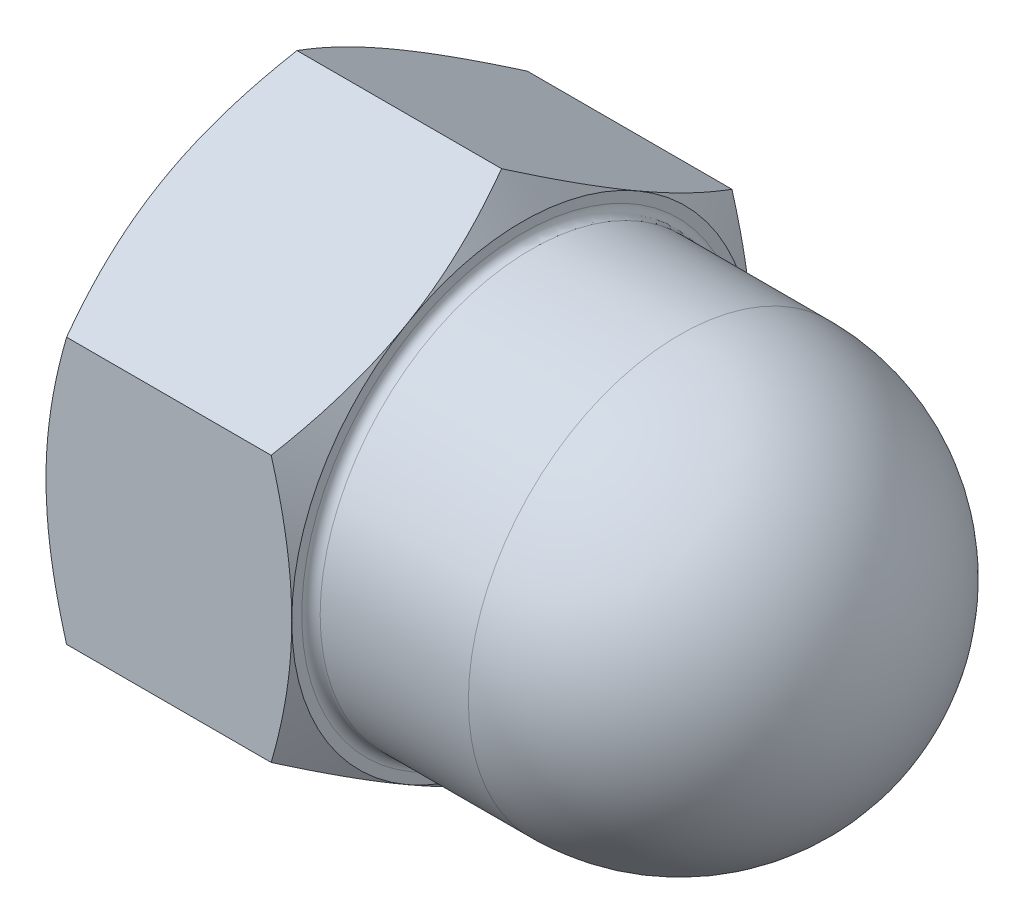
ISO-10303-21;
HEADER;
FILE_DESCRIPTION(('STEP AP214'),'2;1');
FILE_NAME('part.step','',(''),(''),'','','');
FILE_SCHEMA(('AUTOMOTIVE_DESIGN { 1 0 10303 214 1 1 1 1 }'));
ENDSEC;
DATA;
#1=APPLICATION_CONTEXT('core data for automotive mechanical design processes');
#2=APPLICATION_PROTOCOL_DEFINITION('international standard','automotive_design',2000,#1);
#3=PRODUCT_CONTEXT('',#1,'mechanical');
#4=PRODUCT('Part','Part','',(#3));
#5=PRODUCT_RELATED_PRODUCT_CATEGORY('part','',(#4));
#6=PRODUCT_DEFINITION_FORMATION('','',#4);
#7=PRODUCT_DEFINITION_CONTEXT('part definition',#1,'design');
#8=PRODUCT_DEFINITION('design','',#6,#7);
#9=PRODUCT_DEFINITION_SHAPE('','',#8);
#10=(LENGTH_UNIT() NAMED_UNIT(*) SI_UNIT(.MILLI.,.METRE.));
#11=(NAMED_UNIT(*) PLANE_ANGLE_UNIT() SI_UNIT($,.RADIAN.));
#12=(NAMED_UNIT(*) SI_UNIT($,.STERADIAN.) SOLID_ANGLE_UNIT());
#13=UNCERTAINTY_MEASURE_WITH_UNIT(LENGTH_MEASURE(1.E-05),#10,'distance_accuracy_value','');
#14=(GEOMETRIC_REPRESENTATION_CONTEXT(3) GLOBAL_UNCERTAINTY_ASSIGNED_CONTEXT((#13)) GLOBAL_UNIT_ASSIGNED_CONTEXT((#10,
#11,#12)) REPRESENTATION_CONTEXT('',''));
#15=CARTESIAN_POINT('',(0.,0.,0.));
#16=DIRECTION('',(0.,0.,1.));
#17=DIRECTION('',(1.,0.,0.));
#18=AXIS2_PLACEMENT_3D('',#15,#16,#17);
#19=CARTESIAN_POINT('',(0.,1.73205080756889,3.));
#20=DIRECTION('',(1.,0.,0.));
#21=DIRECTION('',(0.,0.,-1.));
#22=AXIS2_PLACEMENT_3D('',#19,#20,#21);
#23=PLANE('',#22);
#24=CARTESIAN_POINT('',(0.,0.,0.));
#25=DIRECTION('',(1.,0.,0.));
#26=DIRECTION('',(0.,0.,-1.));
#27=AXIS2_PLACEMENT_3D('',#24,#25,#26);
#28=CIRCLE('',#27,2.);
#29=CARTESIAN_POINT('',(0.,0.,-2.));
#30=VERTEX_POINT('',#29);
#31=EDGE_CURVE('E300',#30,#30,#28,.T.);
#32=ORIENTED_EDGE('',*,*,#31,.T.);
#33=EDGE_LOOP('',(#32));
#34=FACE_BOUND('',#33,.T.);
#35=CARTESIAN_POINT('',(0.,0.,0.));
#36=DIRECTION('',(1.,0.,0.));
#37=DIRECTION('',(0.,0.,-1.));
#38=AXIS2_PLACEMENT_3D('',#35,#36,#37);
#39=CIRCLE('',#38,3.);
#40=CARTESIAN_POINT('',(0.,0.,-3.));
#41=VERTEX_POINT('',#40);
#42=CARTESIAN_POINT('',(0.,2.59807621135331,-1.50000000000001));
#43=VERTEX_POINT('',#42);
#44=EDGE_CURVE('E181',#41,#43,#39,.T.);
#45=ORIENTED_EDGE('',*,*,#44,.F.);
#46=CARTESIAN_POINT('',(0.,-2.59807621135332,-1.49999999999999));
#47=VERTEX_POINT('',#46);
#48=EDGE_CURVE('E182',#47,#41,#39,.T.);
#49=ORIENTED_EDGE('',*,*,#48,.F.);
#50=CARTESIAN_POINT('',(0.,-2.59807621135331,1.50000000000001));
#51=VERTEX_POINT('',#50);
#52=EDGE_CURVE('E345',#51,#47,#39,.T.);
#53=ORIENTED_EDGE('',*,*,#52,.F.);
#54=CARTESIAN_POINT('',(0.,0.,3.));
#55=VERTEX_POINT('',#54);
#56=EDGE_CURVE('E350',#55,#51,#39,.T.);
#57=ORIENTED_EDGE('',*,*,#56,.F.);
#58=CARTESIAN_POINT('',(0.,0.,0.));
#59=DIRECTION('',(-1.,0.,0.));
#60=DIRECTION('',(0.,0.,1.));
#61=AXIS2_PLACEMENT_3D('',#58,#59,#60);
#62=CIRCLE('',#61,3.);
#63=CARTESIAN_POINT('',(0.,2.59807621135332,1.49999999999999));
#64=VERTEX_POINT('',#63);
#65=EDGE_CURVE('E292',#55,#64,#62,.T.);
#66=ORIENTED_EDGE('',*,*,#65,.T.);
#67=EDGE_CURVE('E352',#43,#64,#39,.T.);
#68=ORIENTED_EDGE('',*,*,#67,.F.);
#69=EDGE_LOOP('',(#45,#49,#53,#57,#66,#68));
#70=FACE_BOUND('',#69,.T.);
#71=ADVANCED_FACE('F32',(#34,#70),#23,.F.);
#72=CARTESIAN_POINT('',(3.2,1.73205080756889,3.));
#73=DIRECTION('',(1.,0.,0.));
#74=DIRECTION('',(0.,0.,-1.));
#75=AXIS2_PLACEMENT_3D('',#72,#73,#74);
#76=PLANE('',#75);
#77=CARTESIAN_POINT('',(3.2,0.,0.));
#78=DIRECTION('',(1.,0.,0.));
#79=DIRECTION('',(0.,0.,-1.));
#80=AXIS2_PLACEMENT_3D('',#77,#78,#79);
#81=CIRCLE('',#80,2.87);
#82=CARTESIAN_POINT('',(3.2,0.,-2.87));
#83=VERTEX_POINT('',#82);
#84=EDGE_CURVE('E40',#83,#83,#81,.F.);
#85=ORIENTED_EDGE('',*,*,#84,.T.);
#86=EDGE_LOOP('',(#85));
#87=FACE_BOUND('',#86,.T.);
#88=CARTESIAN_POINT('',(3.2,0.,0.));
#89=DIRECTION('',(-1.,0.,0.));
#90=DIRECTION('',(0.,0.,1.));
#91=AXIS2_PLACEMENT_3D('',#88,#89,#90);
#92=CIRCLE('',#91,3.);
#93=CARTESIAN_POINT('',(3.2,0.,-3.));
#94=VERTEX_POINT('',#93);
#95=CARTESIAN_POINT('',(3.2,-2.59807621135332,-1.5));
#96=VERTEX_POINT('',#95);
#97=EDGE_CURVE('E289',#94,#96,#92,.T.);
#98=ORIENTED_EDGE('',*,*,#97,.F.);
#99=CARTESIAN_POINT('',(3.2,2.59807621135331,-1.50000000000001));
#100=VERTEX_POINT('',#99);
#101=EDGE_CURVE('E291',#100,#94,#92,.T.);
#102=ORIENTED_EDGE('',*,*,#101,.F.);
#103=CARTESIAN_POINT('',(3.2,2.59807621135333,1.5));
#104=VERTEX_POINT('',#103);
#105=EDGE_CURVE('E295',#104,#100,#92,.T.);
#106=ORIENTED_EDGE('',*,*,#105,.F.);
#107=CARTESIAN_POINT('',(3.2,0.,3.));
#108=VERTEX_POINT('',#107);
#109=EDGE_CURVE('E293',#108,#104,#92,.T.);
#110=ORIENTED_EDGE('',*,*,#109,.F.);
#111=CARTESIAN_POINT('',(3.2,-2.59807621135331,1.50000000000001));
#112=VERTEX_POINT('',#111);
#113=EDGE_CURVE('E47',#112,#108,#92,.T.);
#114=ORIENTED_EDGE('',*,*,#113,.F.);
#115=EDGE_CURVE('E55',#96,#112,#92,.T.);
#116=ORIENTED_EDGE('',*,*,#115,.F.);
#117=EDGE_LOOP('',(#98,#102,#106,#110,#114,#116));
#118=FACE_BOUND('',#117,.T.);
#119=ADVANCED_FACE('F141',(#87,#118),#76,.T.);
#120=CARTESIAN_POINT('',(5.25,0.,0.));
#121=DIRECTION('',(-1.,0.,0.));
#122=DIRECTION('',(0.,-1.,0.));
#123=AXIS2_PLACEMENT_3D('',#120,#121,#122);
#124=SPHERICAL_SURFACE('',#123,2.75);
#125=CARTESIAN_POINT('',(5.25,0.,0.));
#126=DIRECTION('',(-1.,0.,0.));
#127=DIRECTION('',(0.,0.,1.));
#128=AXIS2_PLACEMENT_3D('',#125,#126,#127);
#129=CIRCLE('',#128,2.75);
#130=CARTESIAN_POINT('',(5.25,0.,2.75));
#131=VERTEX_POINT('',#130);
#132=EDGE_CURVE('E329',#131,#131,#129,.T.);
#133=ORIENTED_EDGE('',*,*,#132,.F.);
#134=EDGE_LOOP('',(#133));
#135=FACE_BOUND('',#134,.T.);
#136=ADVANCED_FACE('F147',(#135),#124,.T.);
#137=CARTESIAN_POINT('',(0.,0.,0.));
#138=DIRECTION('',(-1.,0.,0.));
#139=DIRECTION('',(0.,0.,1.));
#140=AXIS2_PLACEMENT_3D('',#137,#138,#139);
#141=CYLINDRICAL_SURFACE('',#140,2.75);
#142=CARTESIAN_POINT('',(3.32,0.,0.));
#143=DIRECTION('',(1.,0.,0.));
#144=DIRECTION('',(0.,0.,-1.));
#145=AXIS2_PLACEMENT_3D('',#142,#143,#144);
#146=CIRCLE('',#145,2.75);
#147=CARTESIAN_POINT('',(3.32,0.,-2.75));
#148=VERTEX_POINT('',#147);
#149=EDGE_CURVE('E11',#148,#148,#146,.T.);
#150=ORIENTED_EDGE('',*,*,#149,.T.);
#151=EDGE_LOOP('',(#150));
#152=FACE_BOUND('',#151,.T.);
#153=ORIENTED_EDGE('',*,*,#132,.T.);
#154=EDGE_LOOP('',(#153));
#155=FACE_BOUND('',#154,.T.);
#156=ADVANCED_FACE('F195',(#152,#155),#141,.T.);
#157=CARTESIAN_POINT('',(2.64337567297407,0.,0.));
#158=DIRECTION('',(-1.,0.,0.));
#159=DIRECTION('',(0.,0.,1.));
#160=AXIS2_PLACEMENT_3D('',#157,#158,#159);
#161=CONICAL_SURFACE('',#160,3.96410161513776,1.0471975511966);
#162=CARTESIAN_POINT('',(2.93198413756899,3.4642170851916,-0.000200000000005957));
#163=CARTESIAN_POINT('',(2.97594629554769,3.38810199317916,0.131635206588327));
#164=CARTESIAN_POINT('',(3.01592841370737,3.31132988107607,0.264608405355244));
#165=CARTESIAN_POINT('',(3.08571791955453,3.15645624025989,0.532857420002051));
#166=CARTESIAN_POINT('',(3.11550061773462,3.07835195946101,0.668138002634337));
#167=CARTESIAN_POINT('',(3.16186216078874,2.9231113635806,0.937022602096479));
#168=CARTESIAN_POINT('',(3.17874955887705,2.84599893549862,1.07058524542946));
#169=CARTESIAN_POINT('',(3.19891035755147,2.69141120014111,1.33833905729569));
#170=CARTESIAN_POINT('',(3.20220045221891,2.61393645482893,1.47252925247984));
#171=CARTESIAN_POINT('',(3.1953594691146,2.46916798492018,1.7232755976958));
#172=CARTESIAN_POINT('',(3.18690808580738,2.40185259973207,1.83986926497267));
#173=CARTESIAN_POINT('',(3.16012105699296,2.26766039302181,2.07229698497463));
#174=CARTESIAN_POINT('',(3.14177625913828,2.20078403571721,2.18813023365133));
#175=CARTESIAN_POINT('',(3.09591524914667,2.06631510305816,2.42103725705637));
#176=CARTESIAN_POINT('',(3.06820461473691,1.99873954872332,2.53808155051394));
#177=CARTESIAN_POINT('',(3.0053122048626,1.8645963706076,2.77042435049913));
#178=CARTESIAN_POINT('',(2.97014520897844,1.79802702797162,2.88572583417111));
#179=CARTESIAN_POINT('',(2.93198413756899,1.73193533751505,3.0002));
#180=B_SPLINE_CURVE_WITH_KNOTS('',3,(#162,#163,#164,#165,#166,#167,#168,#169,#170,#171,#172,
#173,#174,#175,#176,#177,#178,#179),.UNSPECIFIED.,.F.,.F.,(4,2,2,2,2,2,2,2,4),(0.,
0.475539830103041,0.952222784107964,1.41710776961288,1.88142182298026,2.28572436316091,
2.69040156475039,3.10405572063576,3.51689749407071),.UNSPECIFIED.);
#181=CARTESIAN_POINT('',(2.93205080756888,3.46410161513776,0.));
#182=VERTEX_POINT('',#181);
#183=EDGE_CURVE('E209',#182,#104,#180,.T.);
#184=ORIENTED_EDGE('',*,*,#183,.T.);
#185=ORIENTED_EDGE('',*,*,#105,.T.);
#186=CARTESIAN_POINT('',(2.93198413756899,1.73193533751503,-3.0002));
#187=CARTESIAN_POINT('',(2.9759462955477,1.80805042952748,-2.86836479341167));
#188=CARTESIAN_POINT('',(3.01592841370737,1.88482254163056,-2.73539159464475));
#189=CARTESIAN_POINT('',(3.08571791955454,2.03969618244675,-2.46714257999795));
#190=CARTESIAN_POINT('',(3.11550061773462,2.11780046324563,-2.33186199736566));
#191=CARTESIAN_POINT('',(3.16186216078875,2.27304105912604,-2.06297739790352));
#192=CARTESIAN_POINT('',(3.17874955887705,2.35015348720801,-1.92941475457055));
#193=CARTESIAN_POINT('',(3.19891035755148,2.50474122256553,-1.66166094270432));
#194=CARTESIAN_POINT('',(3.20220045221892,2.58221596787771,-1.52747074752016));
#195=CARTESIAN_POINT('',(3.19535946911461,2.72698443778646,-1.2767244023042));
#196=CARTESIAN_POINT('',(3.18690808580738,2.79429982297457,-1.16013073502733));
#197=CARTESIAN_POINT('',(3.16012105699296,2.92849202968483,-0.927703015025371));
#198=CARTESIAN_POINT('',(3.14177625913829,2.99536838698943,-0.811869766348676));
#199=CARTESIAN_POINT('',(3.09591524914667,3.12983731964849,-0.578962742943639));
#200=CARTESIAN_POINT('',(3.06820461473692,3.19741287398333,-0.461918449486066));
#201=CARTESIAN_POINT('',(3.0053122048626,3.33155605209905,-0.229575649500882));
#202=CARTESIAN_POINT('',(2.97014520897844,3.39812539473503,-0.1142741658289));
#203=CARTESIAN_POINT('',(2.93198413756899,3.4642170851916,0.000199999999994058));
#204=B_SPLINE_CURVE_WITH_KNOTS('',3,(#186,#187,#188,#189,#190,#191,#192,#193,#194,#195,#196,
#197,#198,#199,#200,#201,#202,#203),.UNSPECIFIED.,.F.,.F.,(4,2,2,2,2,2,2,2,4),(0.,
0.475539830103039,0.952222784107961,1.41710776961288,1.88142182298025,2.28572436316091,
2.69040156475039,3.10405572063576,3.5168974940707),.UNSPECIFIED.);
#205=EDGE_CURVE('E173',#100,#182,#204,.T.);
#206=ORIENTED_EDGE('',*,*,#205,.T.);
#207=EDGE_LOOP('',(#184,#185,#206));
#208=FACE_BOUND('',#207,.T.);
#209=ADVANCED_FACE('F191',(#208),#161,.T.);
#210=CARTESIAN_POINT('',(2.93205080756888,1.73205080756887,-3.));
#211=VERTEX_POINT('',#210);
#212=EDGE_CURVE('E180',#211,#100,#204,.T.);
#213=ORIENTED_EDGE('',*,*,#212,.T.);
#214=ORIENTED_EDGE('',*,*,#101,.T.);
#215=CARTESIAN_POINT('',(1.74498110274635,-4.63381483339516,-3.));
#216=CARTESIAN_POINT('',(1.80839045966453,-4.50294269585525,-3.));
#217=CARTESIAN_POINT('',(1.87118639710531,-4.37176811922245,-3.));
#218=CARTESIAN_POINT('',(1.99520605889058,-4.10865318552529,-3.));
#219=CARTESIAN_POINT('',(2.05642953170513,-3.97671271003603,-3.));
#220=CARTESIAN_POINT('',(2.17727092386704,-3.71121624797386,-3.));
#221=CARTESIAN_POINT('',(2.23687812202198,-3.57765536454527,-3.));
#222=CARTESIAN_POINT('',(2.35362814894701,-3.30946475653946,-3.));
#223=CARTESIAN_POINT('',(2.41077109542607,-3.17483508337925,-3.));
#224=CARTESIAN_POINT('',(2.5236989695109,-2.90001561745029,-3.));
#225=CARTESIAN_POINT('',(2.57938396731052,-2.75978453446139,-3.));
#226=CARTESIAN_POINT('',(2.68649405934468,-2.47767482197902,-3.));
#227=CARTESIAN_POINT('',(2.73791867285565,-2.33579600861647,-3.));
#228=CARTESIAN_POINT('',(2.83514427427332,-2.05043684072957,-3.));
#229=CARTESIAN_POINT('',(2.88095681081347,-1.90696046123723,-3.));
#230=CARTESIAN_POINT('',(2.96547582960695,-1.61794974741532,-3.));
#231=CARTESIAN_POINT('',(3.00418457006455,-1.47241608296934,-3.));
#232=CARTESIAN_POINT('',(3.07242055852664,-1.18001482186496,-3.));
#233=CARTESIAN_POINT('',(3.10199702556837,-1.0331589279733,-3.));
#234=CARTESIAN_POINT('',(3.15028461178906,-0.73764051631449,-3.));
#235=CARTESIAN_POINT('',(3.16899672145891,-0.58897816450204,-3.));
#236=CARTESIAN_POINT('',(3.19381749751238,-0.292523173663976,-3.));
#237=CARTESIAN_POINT('',(3.2000866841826,-0.144744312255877,-3.));
#238=CARTESIAN_POINT('',(3.19991154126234,0.150817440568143,-3.));
#239=CARTESIAN_POINT('',(3.19346693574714,0.298600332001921,-3.));
#240=CARTESIAN_POINT('',(3.17213777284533,0.55005252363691,-3.));
#241=CARTESIAN_POINT('',(3.16026989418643,0.653993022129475,-3.));
#242=CARTESIAN_POINT('',(3.13099429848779,0.861098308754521,-3.));
#243=CARTESIAN_POINT('',(3.11358581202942,0.964262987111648,-3.));
#244=CARTESIAN_POINT('',(3.05396332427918,1.27245094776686,-3.));
#245=CARTESIAN_POINT('',(3.0043637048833,1.47604918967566,-3.));
#246=CARTESIAN_POINT('',(2.88958639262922,1.88346424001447,-3.));
#247=CARTESIAN_POINT('',(2.8240911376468,2.08718806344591,-3.));
#248=CARTESIAN_POINT('',(2.7180431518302,2.38995030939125,-3.));
#249=CARTESIAN_POINT('',(2.68139740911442,2.49038964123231,-3.));
#250=CARTESIAN_POINT('',(2.60591450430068,2.69044155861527,-3.));
#251=CARTESIAN_POINT('',(2.56707736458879,2.79005415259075,-3.));
#252=CARTESIAN_POINT('',(2.47504550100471,3.01984681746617,-3.));
#253=CARTESIAN_POINT('',(2.4211855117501,3.14975962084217,-3.));
#254=CARTESIAN_POINT('',(2.31095678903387,3.40851905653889,-3.));
#255=CARTESIAN_POINT('',(2.25458792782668,3.53736563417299,-3.));
#256=CARTESIAN_POINT('',(2.08247392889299,3.92261344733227,-3.));
#257=CARTESIAN_POINT('',(1.96373985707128,4.17767769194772,-3.));
#258=CARTESIAN_POINT('',(1.72092663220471,4.68551897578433,-3.));
#259=CARTESIAN_POINT('',(1.59684252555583,4.93829362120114,-3.));
#260=CARTESIAN_POINT('',(1.34504342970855,5.44203435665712,-3.));
#261=CARTESIAN_POINT('',(1.2173283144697,5.69300038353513,-3.));
#262=CARTESIAN_POINT('',(0.969697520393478,6.17344673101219,-3.));
#263=CARTESIAN_POINT('',(0.849981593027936,6.40303035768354,-3.));
#264=CARTESIAN_POINT('',(0.60889531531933,6.86133570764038,-3.));
#265=CARTESIAN_POINT('',(0.487524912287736,7.09005740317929,-3.));
#266=CARTESIAN_POINT('',(0.243802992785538,7.54629005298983,-3.));
#267=CARTESIAN_POINT('',(0.121454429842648,7.77380258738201,-3.));
#268=CARTESIAN_POINT('',(-0.124240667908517,8.22827314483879,-3.));
#269=CARTESIAN_POINT('',(-0.247587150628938,8.45523119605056,-3.));
#270=CARTESIAN_POINT('',(-0.371307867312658,8.68198362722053,-3.));
#271=B_SPLINE_CURVE_WITH_KNOTS('',3,(#215,#216,#217,#218,#219,#220,#221,#222,#223,#224,#225,
#226,#227,#228,#229,#230,#231,#232,#233,#234,#235,#236,#237,#238,#239,#240,#241,#242,#243,#244,
#245,#246,#247,#248,#249,#250,#251,#252,#253,#254,#255,#256,#257,#258,#259,#260,#261,#262,#263,
#264,#265,#266,#267,#268,#269,#270),.UNSPECIFIED.,.F.,.F.,(4,2,2,2,2,2,2,2,2,2,2,2,2,2,2,2,2,2,
2,2,2,2,2,2,2,2,2,4),(0.,0.43627869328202,0.872626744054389,1.31138210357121,1.7501164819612,
2.2027109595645,2.65535643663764,3.10705422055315,3.55860816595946,4.00768414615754,
4.45671917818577,4.89992276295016,5.34313596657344,5.65683214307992,5.97057190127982,
6.59840828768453,7.24000322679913,7.56073051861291,7.88145453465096,8.30332567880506,
8.72521832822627,9.56914969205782,10.4138799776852,11.2586396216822,12.0353974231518,
12.8121800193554,13.5871483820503,14.3620765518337),.UNSPECIFIED.);
#272=EDGE_CURVE('E202',#211,#94,#271,.F.);
#273=ORIENTED_EDGE('',*,*,#272,.F.);
#274=EDGE_LOOP('',(#213,#214,#273));
#275=FACE_BOUND('',#274,.T.);
#276=ADVANCED_FACE('F186',(#275),#161,.T.);
#277=CARTESIAN_POINT('',(2.93198413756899,-3.4642170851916,0.000200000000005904));
#278=CARTESIAN_POINT('',(2.97594629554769,-3.38810199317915,-0.131635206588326));
#279=CARTESIAN_POINT('',(3.01592841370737,-3.31132988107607,-0.264608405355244));
#280=CARTESIAN_POINT('',(3.08571791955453,-3.15645624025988,-0.532857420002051));
#281=CARTESIAN_POINT('',(3.11550061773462,-3.078351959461,-0.668138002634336));
#282=CARTESIAN_POINT('',(3.16186216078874,-2.92311136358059,-0.937022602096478));
#283=CARTESIAN_POINT('',(3.17874955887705,-2.84599893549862,-1.07058524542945));
#284=CARTESIAN_POINT('',(3.19891035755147,-2.6914112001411,-1.33833905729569));
#285=CARTESIAN_POINT('',(3.20220045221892,-2.61393645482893,-1.47252925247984));
#286=CARTESIAN_POINT('',(3.19535946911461,-2.46916798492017,-1.7232755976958));
#287=CARTESIAN_POINT('',(3.18690808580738,-2.40185259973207,-1.83986926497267));
#288=CARTESIAN_POINT('',(3.16012105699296,-2.26766039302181,-2.07229698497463));
#289=CARTESIAN_POINT('',(3.14177625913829,-2.20078403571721,-2.18813023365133));
#290=CARTESIAN_POINT('',(3.09591524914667,-2.06631510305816,-2.42103725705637));
#291=CARTESIAN_POINT('',(3.06820461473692,-1.99873954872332,-2.53808155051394));
#292=CARTESIAN_POINT('',(3.0053122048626,-1.8645963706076,-2.77042435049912));
#293=CARTESIAN_POINT('',(2.97014520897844,-1.79802702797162,-2.88572583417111));
#294=CARTESIAN_POINT('',(2.93198413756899,-1.73193533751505,-3.0002));
#295=B_SPLINE_CURVE_WITH_KNOTS('',3,(#277,#278,#279,#280,#281,#282,#283,#284,#285,#286,#287,
#288,#289,#290,#291,#292,#293,#294),.UNSPECIFIED.,.F.,.F.,(4,2,2,2,2,2,2,2,4),(0.,
0.475539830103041,0.952222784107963,1.41710776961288,1.88142182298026,2.28572436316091,
2.69040156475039,3.10405572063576,3.5168974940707),.UNSPECIFIED.);
#296=CARTESIAN_POINT('',(2.9320508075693,-1.73205080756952,-3.));
#297=VERTEX_POINT('',#296);
#298=EDGE_CURVE('E214',#96,#297,#295,.T.);
#299=ORIENTED_EDGE('',*,*,#298,.T.);
#300=EDGE_CURVE('E267',#94,#297,#271,.F.);
#301=ORIENTED_EDGE('',*,*,#300,.F.);
#302=ORIENTED_EDGE('',*,*,#97,.T.);
#303=EDGE_LOOP('',(#299,#301,#302));
#304=FACE_BOUND('',#303,.T.);
#305=ADVANCED_FACE('F190',(#304),#161,.T.);
#306=CARTESIAN_POINT('',(2.931984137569,-1.73193533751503,3.0002));
#307=CARTESIAN_POINT('',(2.9759462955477,-1.80805042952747,2.86836479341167));
#308=CARTESIAN_POINT('',(3.01592841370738,-1.88482254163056,2.73539159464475));
#309=CARTESIAN_POINT('',(3.08571791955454,-2.03969618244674,2.46714257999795));
#310=CARTESIAN_POINT('',(3.11550061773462,-2.11780046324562,2.33186199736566));
#311=CARTESIAN_POINT('',(3.16186216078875,-2.27304105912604,2.06297739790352));
#312=CARTESIAN_POINT('',(3.17874955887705,-2.35015348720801,1.92941475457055));
#313=CARTESIAN_POINT('',(3.19891035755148,-2.50474122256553,1.66166094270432));
#314=CARTESIAN_POINT('',(3.20220045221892,-2.58221596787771,1.52747074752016));
#315=CARTESIAN_POINT('',(3.19535946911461,-2.72698443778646,1.2767244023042));
#316=CARTESIAN_POINT('',(3.18690808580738,-2.79429982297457,1.16013073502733));
#317=CARTESIAN_POINT('',(3.16012105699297,-2.92849202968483,0.927703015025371));
#318=CARTESIAN_POINT('',(3.14177625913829,-2.99536838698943,0.811869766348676));
#319=CARTESIAN_POINT('',(3.09591524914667,-3.12983731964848,0.57896274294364));
#320=CARTESIAN_POINT('',(3.06820461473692,-3.19741287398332,0.461918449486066));
#321=CARTESIAN_POINT('',(3.0053122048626,-3.33155605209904,0.229575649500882));
#322=CARTESIAN_POINT('',(2.97014520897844,-3.39812539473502,0.1142741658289));
#323=CARTESIAN_POINT('',(2.93198413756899,-3.4642170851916,-0.000199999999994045));
#324=B_SPLINE_CURVE_WITH_KNOTS('',3,(#306,#307,#308,#309,#310,#311,#312,#313,#314,#315,#316,
#317,#318,#319,#320,#321,#322,#323),.UNSPECIFIED.,.F.,.F.,(4,2,2,2,2,2,2,2,4),(0.,
0.475539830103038,0.95222278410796,1.41710776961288,1.88142182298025,2.28572436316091,
2.69040156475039,3.10405572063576,3.5168974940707),.UNSPECIFIED.);
#325=CARTESIAN_POINT('',(2.93205080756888,-3.46410161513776,0.));
#326=VERTEX_POINT('',#325);
#327=EDGE_CURVE('E219',#112,#326,#324,.T.);
#328=ORIENTED_EDGE('',*,*,#327,.T.);
#329=EDGE_CURVE('E225',#326,#96,#295,.T.);
#330=ORIENTED_EDGE('',*,*,#329,.T.);
#331=ORIENTED_EDGE('',*,*,#115,.T.);
#332=EDGE_LOOP('',(#328,#330,#331));
#333=FACE_BOUND('',#332,.T.);
#334=ADVANCED_FACE('F279',(#333),#161,.T.);
#335=CARTESIAN_POINT('',(1.74498110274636,-4.63381483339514,3.));
#336=CARTESIAN_POINT('',(1.80839045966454,-4.50294269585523,3.));
#337=CARTESIAN_POINT('',(1.87118639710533,-4.37176811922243,3.));
#338=CARTESIAN_POINT('',(1.99520605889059,-4.10865318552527,3.));
#339=CARTESIAN_POINT('',(2.05642953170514,-3.976712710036,3.));
#340=CARTESIAN_POINT('',(2.17727092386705,-3.71121624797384,3.));
#341=CARTESIAN_POINT('',(2.23687812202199,-3.57765536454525,3.));
#342=CARTESIAN_POINT('',(2.35362814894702,-3.30946475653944,3.));
#343=CARTESIAN_POINT('',(2.41077109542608,-3.17483508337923,3.));
#344=CARTESIAN_POINT('',(2.52369896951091,-2.90001561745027,3.));
#345=CARTESIAN_POINT('',(2.57938396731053,-2.75978453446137,3.));
#346=CARTESIAN_POINT('',(2.68649405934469,-2.477674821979,3.));
#347=CARTESIAN_POINT('',(2.73791867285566,-2.33579600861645,3.));
#348=CARTESIAN_POINT('',(2.83514427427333,-2.05043684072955,3.));
#349=CARTESIAN_POINT('',(2.88095681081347,-1.90696046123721,3.));
#350=CARTESIAN_POINT('',(2.96547582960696,-1.6179497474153,3.));
#351=CARTESIAN_POINT('',(3.00418457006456,-1.47241608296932,3.));
#352=CARTESIAN_POINT('',(3.07242055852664,-1.18001482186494,3.));
#353=CARTESIAN_POINT('',(3.10199702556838,-1.03315892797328,3.));
#354=CARTESIAN_POINT('',(3.15028461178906,-0.737640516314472,3.));
#355=CARTESIAN_POINT('',(3.16899672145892,-0.588978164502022,3.));
#356=CARTESIAN_POINT('',(3.19381749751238,-0.292523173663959,3.));
#357=CARTESIAN_POINT('',(3.2000866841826,-0.14474431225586,3.));
#358=CARTESIAN_POINT('',(3.19991154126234,0.15081744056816,3.));
#359=CARTESIAN_POINT('',(3.19346693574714,0.298600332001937,3.));
#360=CARTESIAN_POINT('',(3.17213777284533,0.550052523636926,3.));
#361=CARTESIAN_POINT('',(3.16026989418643,0.653993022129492,3.));
#362=CARTESIAN_POINT('',(3.13099429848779,0.861098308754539,3.));
#363=CARTESIAN_POINT('',(3.11358581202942,0.964262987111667,3.));
#364=CARTESIAN_POINT('',(3.05396332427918,1.27245094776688,3.));
#365=CARTESIAN_POINT('',(3.0043637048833,1.47604918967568,3.));
#366=CARTESIAN_POINT('',(2.88958639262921,1.88346424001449,3.));
#367=CARTESIAN_POINT('',(2.82409113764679,2.08718806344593,3.));
#368=CARTESIAN_POINT('',(2.71804315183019,2.38995030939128,3.));
#369=CARTESIAN_POINT('',(2.68139740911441,2.49038964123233,3.));
#370=CARTESIAN_POINT('',(2.60591450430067,2.6904415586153,3.));
#371=CARTESIAN_POINT('',(2.56707736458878,2.79005415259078,3.));
#372=CARTESIAN_POINT('',(2.4750455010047,3.0198468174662,3.));
#373=CARTESIAN_POINT('',(2.42118551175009,3.14975962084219,3.));
#374=CARTESIAN_POINT('',(2.31095678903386,3.40851905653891,3.));
#375=CARTESIAN_POINT('',(2.25458792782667,3.53736563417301,3.));
#376=CARTESIAN_POINT('',(2.08247392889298,3.9226134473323,3.));
#377=CARTESIAN_POINT('',(1.96373985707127,4.17767769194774,3.));
#378=CARTESIAN_POINT('',(1.7209266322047,4.68551897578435,3.));
#379=CARTESIAN_POINT('',(1.59684252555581,4.93829362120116,3.));
#380=CARTESIAN_POINT('',(1.34504342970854,5.44203435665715,3.));
#381=CARTESIAN_POINT('',(1.21732831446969,5.69300038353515,3.));
#382=CARTESIAN_POINT('',(0.969697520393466,6.17344673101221,3.));
#383=CARTESIAN_POINT('',(0.849981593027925,6.40303035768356,3.));
#384=CARTESIAN_POINT('',(0.608895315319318,6.8613357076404,3.));
#385=CARTESIAN_POINT('',(0.487524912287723,7.09005740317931,3.));
#386=CARTESIAN_POINT('',(0.243802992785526,7.54629005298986,3.));
#387=CARTESIAN_POINT('',(0.121454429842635,7.77380258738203,3.));
#388=CARTESIAN_POINT('',(-0.124240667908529,8.22827314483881,3.));
#389=CARTESIAN_POINT('',(-0.24758715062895,8.45523119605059,3.));
#390=CARTESIAN_POINT('',(-0.37130786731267,8.68198362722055,3.));
#391=B_SPLINE_CURVE_WITH_KNOTS('',3,(#335,#336,#337,#338,#339,#340,#341,#342,#343,#344,#345,
#346,#347,#348,#349,#350,#351,#352,#353,#354,#355,#356,#357,#358,#359,#360,#361,#362,#363,#364,
#365,#366,#367,#368,#369,#370,#371,#372,#373,#374,#375,#376,#377,#378,#379,#380,#381,#382,#383,
#384,#385,#386,#387,#388,#389,#390),.UNSPECIFIED.,.F.,.F.,(4,2,2,2,2,2,2,2,2,2,2,2,2,2,2,2,2,2,
2,2,2,2,2,2,2,2,2,4),(0.,0.436278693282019,0.872626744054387,1.3113821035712,1.7501164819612,
2.2027109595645,2.65535643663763,3.10705422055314,3.55860816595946,4.00768414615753,
4.45671917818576,4.89992276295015,5.34313596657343,5.65683214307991,5.97057190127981,
6.59840828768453,7.24000322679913,7.56073051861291,7.88145453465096,8.30332567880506,
8.72521832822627,9.56914969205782,10.4138799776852,11.2586396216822,12.0353974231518,
12.8121800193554,13.5871483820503,14.3620765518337),.UNSPECIFIED.);
#392=CARTESIAN_POINT('',(2.93205080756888,-1.73205080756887,3.));
#393=VERTEX_POINT('',#392);
#394=EDGE_CURVE('E226',#108,#393,#391,.F.);
#395=ORIENTED_EDGE('',*,*,#394,.T.);
#396=EDGE_CURVE('E224',#393,#112,#324,.T.);
#397=ORIENTED_EDGE('',*,*,#396,.T.);
#398=ORIENTED_EDGE('',*,*,#113,.T.);
#399=EDGE_LOOP('',(#395,#397,#398));
#400=FACE_BOUND('',#399,.T.);
#401=ADVANCED_FACE('F517',(#400),#161,.T.);
#402=CARTESIAN_POINT('',(2.93205080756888,1.73205080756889,3.));
#403=VERTEX_POINT('',#402);
#404=EDGE_CURVE('E273',#104,#403,#180,.T.);
#405=ORIENTED_EDGE('',*,*,#404,.T.);
#406=EDGE_CURVE('E365',#403,#108,#391,.F.);
#407=ORIENTED_EDGE('',*,*,#406,.T.);
#408=ORIENTED_EDGE('',*,*,#109,.T.);
#409=EDGE_LOOP('',(#405,#407,#408));
#410=FACE_BOUND('',#409,.T.);
#411=ADVANCED_FACE('F159',(#410),#161,.T.);
#412=CARTESIAN_POINT('',(3.2,1.73205080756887,-3.));
#413=DIRECTION('',(0.,-0.866025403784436,0.500000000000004));
#414=DIRECTION('',(0.,-0.500000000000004,-0.866025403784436));
#415=AXIS2_PLACEMENT_3D('',#412,#413,#414);
#416=PLANE('',#415);
#417=ORIENTED_EDGE('',*,*,#212,.F.);
#418=DIRECTION('',(-1.,0.,0.));
#419=VECTOR('',#418,1.);
#420=CARTESIAN_POINT('',(3.2,1.73205080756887,-3.));
#421=LINE('',#420,#419);
#422=CARTESIAN_POINT('',(0.267949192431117,1.73205080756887,-3.));
#423=VERTEX_POINT('',#422);
#424=EDGE_CURVE('E328',#211,#423,#421,.T.);
#425=ORIENTED_EDGE('',*,*,#424,.T.);
#426=CARTESIAN_POINT('',(0.268015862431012,3.4642170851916,0.000199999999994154));
#427=CARTESIAN_POINT('',(0.224053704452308,3.38810199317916,-0.131635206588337));
#428=CARTESIAN_POINT('',(0.18407158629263,3.31132988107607,-0.264608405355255));
#429=CARTESIAN_POINT('',(0.114282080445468,3.15645624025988,-0.53285742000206));
#430=CARTESIAN_POINT('',(0.0844993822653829,3.078351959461,-0.668138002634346));
#431=CARTESIAN_POINT('',(0.0381378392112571,2.92311136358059,-0.937022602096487));
#432=CARTESIAN_POINT('',(0.0212504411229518,2.84599893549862,-1.07058524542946));
#433=CARTESIAN_POINT('',(0.0010896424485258,2.6914112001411,-1.33833905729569));
#434=CARTESIAN_POINT('',(-0.00220045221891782,2.61393645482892,-1.47252925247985));
#435=CARTESIAN_POINT('',(0.0046405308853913,2.46916798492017,-1.72327559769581));
#436=CARTESIAN_POINT('',(0.0130919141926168,2.40185259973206,-1.83986926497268));
#437=CARTESIAN_POINT('',(0.0398789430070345,2.2676603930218,-2.07229698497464));
#438=CARTESIAN_POINT('',(0.0582237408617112,2.2007840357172,-2.18813023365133));
#439=CARTESIAN_POINT('',(0.104084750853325,2.06631510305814,-2.42103725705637));
#440=CARTESIAN_POINT('',(0.13179538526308,1.9987395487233,-2.53808155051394));
#441=CARTESIAN_POINT('',(0.194687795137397,1.86459637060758,-2.77042435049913));
#442=CARTESIAN_POINT('',(0.229854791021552,1.7980270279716,-2.88572583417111));
#443=CARTESIAN_POINT('',(0.268015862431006,1.73193533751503,-3.0002));
#444=B_SPLINE_CURVE_WITH_KNOTS('',3,(#426,#427,#428,#429,#430,#431,#432,#433,#434,#435,#436,
#437,#438,#439,#440,#441,#442,#443),.UNSPECIFIED.,.F.,.F.,(4,2,2,2,2,2,2,2,4),(0.,
0.47553983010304,0.952222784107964,1.41710776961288,1.88142182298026,2.28572436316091,
2.69040156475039,3.10405572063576,3.5168974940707),.UNSPECIFIED.);
#445=EDGE_CURVE('E165',#43,#423,#444,.T.);
#446=ORIENTED_EDGE('',*,*,#445,.F.);
#447=CARTESIAN_POINT('',(0.267949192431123,3.46410161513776,0.));
#448=VERTEX_POINT('',#447);
#449=EDGE_CURVE('E325',#448,#43,#444,.T.);
#450=ORIENTED_EDGE('',*,*,#449,.F.);
#451=DIRECTION('',(-1.,0.,0.));
#452=VECTOR('',#451,1.);
#453=CARTESIAN_POINT('',(3.2,3.46410161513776,0.));
#454=LINE('',#453,#452);
#455=EDGE_CURVE('E322',#182,#448,#454,.T.);
#456=ORIENTED_EDGE('',*,*,#455,.F.);
#457=ORIENTED_EDGE('',*,*,#205,.F.);
#458=EDGE_LOOP('',(#417,#425,#446,#450,#456,#457));
#459=FACE_BOUND('',#458,.T.);
#460=ADVANCED_FACE('F154',(#459),#416,.F.);
#461=CARTESIAN_POINT('',(3.2,1.73205080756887,-3.));
#462=DIRECTION('',(0.,0.,-1.));
#463=DIRECTION('',(0.,1.,0.));
#464=AXIS2_PLACEMENT_3D('',#461,#462,#463);
#465=PLANE('',#464);
#466=ORIENTED_EDGE('',*,*,#424,.F.);
#467=ORIENTED_EDGE('',*,*,#272,.T.);
#468=ORIENTED_EDGE('',*,*,#300,.T.);
#469=DIRECTION('',(-1.,0.,0.));
#470=VECTOR('',#469,1.);
#471=CARTESIAN_POINT('',(3.2,-1.73205080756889,-3.));
#472=LINE('',#471,#470);
#473=CARTESIAN_POINT('',(0.267949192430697,-1.73205080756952,-3.));
#474=VERTEX_POINT('',#473);
#475=EDGE_CURVE('E285',#297,#474,#472,.T.);
#476=ORIENTED_EDGE('',*,*,#475,.T.);
#477=CARTESIAN_POINT('',(1.45501889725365,-4.63381483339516,-3.));
#478=CARTESIAN_POINT('',(1.39160954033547,-4.50294269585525,-3.));
#479=CARTESIAN_POINT('',(1.32881360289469,-4.37176811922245,-3.));
#480=CARTESIAN_POINT('',(1.20479394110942,-4.10865318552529,-3.));
#481=CARTESIAN_POINT('',(1.14357046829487,-3.97671271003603,-3.));
#482=CARTESIAN_POINT('',(1.02272907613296,-3.71121624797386,-3.));
#483=CARTESIAN_POINT('',(0.963121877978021,-3.57765536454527,-3.));
#484=CARTESIAN_POINT('',(0.846371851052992,-3.30946475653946,-3.));
#485=CARTESIAN_POINT('',(0.789228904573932,-3.17483508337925,-3.));
#486=CARTESIAN_POINT('',(0.676301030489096,-2.90001561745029,-3.));
#487=CARTESIAN_POINT('',(0.620616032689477,-2.7597845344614,-3.));
#488=CARTESIAN_POINT('',(0.51350594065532,-2.47767482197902,-3.));
#489=CARTESIAN_POINT('',(0.462081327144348,-2.33579600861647,-3.));
#490=CARTESIAN_POINT('',(0.364855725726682,-2.05043684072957,-3.));
#491=CARTESIAN_POINT('',(0.319043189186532,-1.90696046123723,-3.));
#492=CARTESIAN_POINT('',(0.234524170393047,-1.61794974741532,-3.));
#493=CARTESIAN_POINT('',(0.195815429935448,-1.47241608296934,-3.));
#494=CARTESIAN_POINT('',(0.127579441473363,-1.18001482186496,-3.));
#495=CARTESIAN_POINT('',(0.0980029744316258,-1.0331589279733,-3.));
#496=CARTESIAN_POINT('',(0.0497153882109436,-0.737640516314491,-3.));
#497=CARTESIAN_POINT('',(0.0310032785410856,-0.588978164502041,-3.));
#498=CARTESIAN_POINT('',(0.00618250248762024,-0.292523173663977,-3.));
#499=CARTESIAN_POINT('',(-8.6684182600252E-05,-0.144744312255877,-3.));
#500=CARTESIAN_POINT('',(8.84587376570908E-05,0.150817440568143,-3.));
#501=CARTESIAN_POINT('',(0.00653306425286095,0.298600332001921,-3.));
#502=CARTESIAN_POINT('',(0.027862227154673,0.55005252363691,-3.));
#503=CARTESIAN_POINT('',(0.0397301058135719,0.653993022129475,-3.));
#504=CARTESIAN_POINT('',(0.0690057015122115,0.861098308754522,-3.));
#505=CARTESIAN_POINT('',(0.086414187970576,0.964262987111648,-3.));
#506=CARTESIAN_POINT('',(0.14603667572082,1.27245094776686,-3.));
#507=CARTESIAN_POINT('',(0.195636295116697,1.47604918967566,-3.));
#508=CARTESIAN_POINT('',(0.310413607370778,1.88346424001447,-3.));
#509=CARTESIAN_POINT('',(0.375908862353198,2.08718806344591,-3.));
#510=CARTESIAN_POINT('',(0.481956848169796,2.38995030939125,-3.));
#511=CARTESIAN_POINT('',(0.518602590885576,2.49038964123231,-3.));
#512=CARTESIAN_POINT('',(0.59408549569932,2.69044155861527,-3.));
#513=CARTESIAN_POINT('',(0.632922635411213,2.79005415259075,-3.));
#514=CARTESIAN_POINT('',(0.724954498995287,3.01984681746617,-3.));
#515=CARTESIAN_POINT('',(0.778814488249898,3.14975962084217,-3.));
#516=CARTESIAN_POINT('',(0.889043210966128,3.40851905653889,-3.));
#517=CARTESIAN_POINT('',(0.945412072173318,3.53736563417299,-3.));
#518=CARTESIAN_POINT('',(1.11752607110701,3.92261344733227,-3.));
#519=CARTESIAN_POINT('',(1.23626014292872,4.17767769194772,-3.));
#520=CARTESIAN_POINT('',(1.47907336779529,4.68551897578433,-3.));
#521=CARTESIAN_POINT('',(1.60315747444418,4.93829362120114,-3.));
#522=CARTESIAN_POINT('',(1.85495657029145,5.44203435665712,-3.));
#523=CARTESIAN_POINT('',(1.9826716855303,5.69300038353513,-3.));
#524=CARTESIAN_POINT('',(2.23030247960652,6.17344673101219,-3.));
#525=CARTESIAN_POINT('',(2.35001840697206,6.40303035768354,-3.));
#526=CARTESIAN_POINT('',(2.59110468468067,6.86133570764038,-3.));
#527=CARTESIAN_POINT('',(2.71247508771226,7.09005740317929,-3.));
#528=CARTESIAN_POINT('',(2.95619700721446,7.54629005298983,-3.));
#529=CARTESIAN_POINT('',(3.07854557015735,7.77380258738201,-3.));
#530=CARTESIAN_POINT('',(3.32424066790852,8.22827314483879,-3.));
#531=CARTESIAN_POINT('',(3.44758715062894,8.45523119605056,-3.));
#532=CARTESIAN_POINT('',(3.57130786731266,8.68198362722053,-3.));
#533=B_SPLINE_CURVE_WITH_KNOTS('',3,(#477,#478,#479,#480,#481,#482,#483,#484,#485,#486,#487,
#488,#489,#490,#491,#492,#493,#494,#495,#496,#497,#498,#499,#500,#501,#502,#503,#504,#505,#506,
#507,#508,#509,#510,#511,#512,#513,#514,#515,#516,#517,#518,#519,#520,#521,#522,#523,#524,#525,
#526,#527,#528,#529,#530,#531,#532),.UNSPECIFIED.,.F.,.F.,(4,2,2,2,2,2,2,2,2,2,2,2,2,2,2,2,2,2,
2,2,2,2,2,2,2,2,2,4),(0.,0.43627869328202,0.87262674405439,1.31138210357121,1.7501164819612,
2.2027109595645,2.65535643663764,3.10705422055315,3.55860816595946,4.00768414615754,
4.45671917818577,4.89992276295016,5.34313596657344,5.65683214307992,5.97057190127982,
6.59840828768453,7.24000322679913,7.56073051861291,7.88145453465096,8.30332567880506,
8.72521832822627,9.56914969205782,10.4138799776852,11.2586396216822,12.0353974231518,
12.8121800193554,13.5871483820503,14.3620765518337),.UNSPECIFIED.);
#534=EDGE_CURVE('E370',#474,#41,#533,.T.);
#535=ORIENTED_EDGE('',*,*,#534,.T.);
#536=EDGE_CURVE('E372',#41,#423,#533,.T.);
#537=ORIENTED_EDGE('',*,*,#536,.T.);
#538=EDGE_LOOP('',(#466,#467,#468,#476,#535,#537));
#539=FACE_BOUND('',#538,.T.);
#540=ADVANCED_FACE('F158',(#539),#465,.T.);
#541=CARTESIAN_POINT('',(3.2,-3.46410161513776,0.));
#542=DIRECTION('',(0.,0.86602540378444,0.499999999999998));
#543=DIRECTION('',(0.,-0.499999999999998,0.86602540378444));
#544=AXIS2_PLACEMENT_3D('',#541,#542,#543);
#545=PLANE('',#544);
#546=ORIENTED_EDGE('',*,*,#329,.F.);
#547=DIRECTION('',(-1.,0.,0.));
#548=VECTOR('',#547,1.);
#549=CARTESIAN_POINT('',(3.2,-3.46410161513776,0.));
#550=LINE('',#549,#548);
#551=CARTESIAN_POINT('',(0.267949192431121,-3.46410161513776,0.));
#552=VERTEX_POINT('',#551);
#553=EDGE_CURVE('E335',#326,#552,#550,.T.);
#554=ORIENTED_EDGE('',*,*,#553,.T.);
#555=CARTESIAN_POINT('',(0.26801586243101,-1.73193533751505,-3.0002));
#556=CARTESIAN_POINT('',(0.224053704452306,-1.80805042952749,-2.86836479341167));
#557=CARTESIAN_POINT('',(0.184071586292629,-1.88482254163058,-2.73539159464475));
#558=CARTESIAN_POINT('',(0.114282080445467,-2.03969618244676,-2.46714257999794));
#559=CARTESIAN_POINT('',(0.0844993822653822,-2.11780046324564,-2.33186199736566));
#560=CARTESIAN_POINT('',(0.038137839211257,-2.27304105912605,-2.06297739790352));
#561=CARTESIAN_POINT('',(0.021250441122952,-2.35015348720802,-1.92941475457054));
#562=CARTESIAN_POINT('',(0.0010896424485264,-2.50474122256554,-1.66166094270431));
#563=CARTESIAN_POINT('',(-0.00220045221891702,-2.58221596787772,-1.52747074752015));
#564=CARTESIAN_POINT('',(0.00464053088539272,-2.72698443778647,-1.27672440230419));
#565=CARTESIAN_POINT('',(0.0130919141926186,-2.79429982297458,-1.16013073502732));
#566=CARTESIAN_POINT('',(0.039878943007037,-2.92849202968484,-0.92770301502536));
#567=CARTESIAN_POINT('',(0.0582237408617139,-2.99536838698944,-0.811869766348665));
#568=CARTESIAN_POINT('',(0.104084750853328,-3.12983731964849,-0.578962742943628));
#569=CARTESIAN_POINT('',(0.131795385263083,-3.19741287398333,-0.461918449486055));
#570=CARTESIAN_POINT('',(0.194687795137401,-3.33155605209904,-0.22957564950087));
#571=CARTESIAN_POINT('',(0.229854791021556,-3.39812539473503,-0.114274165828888));
#572=CARTESIAN_POINT('',(0.26801586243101,-3.4642170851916,0.000200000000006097));
#573=B_SPLINE_CURVE_WITH_KNOTS('',3,(#555,#556,#557,#558,#559,#560,#561,#562,#563,#564,#565,
#566,#567,#568,#569,#570,#571,#572),.UNSPECIFIED.,.F.,.F.,(4,2,2,2,2,2,2,2,4),(0.,
0.47553983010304,0.952222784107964,1.41710776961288,1.88142182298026,2.28572436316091,
2.69040156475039,3.10405572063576,3.5168974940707),.UNSPECIFIED.);
#574=EDGE_CURVE('E248',#47,#552,#573,.T.);
#575=ORIENTED_EDGE('',*,*,#574,.F.);
#576=EDGE_CURVE('E369',#474,#47,#573,.T.);
#577=ORIENTED_EDGE('',*,*,#576,.F.);
#578=ORIENTED_EDGE('',*,*,#475,.F.);
#579=ORIENTED_EDGE('',*,*,#298,.F.);
#580=EDGE_LOOP('',(#546,#554,#575,#577,#578,#579));
#581=FACE_BOUND('',#580,.T.);
#582=ADVANCED_FACE('F236',(#581),#545,.F.);
#583=CARTESIAN_POINT('',(3.2,-1.73205080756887,3.));
#584=DIRECTION('',(0.,0.866025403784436,-0.500000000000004));
#585=DIRECTION('',(0.,0.500000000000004,0.866025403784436));
#586=AXIS2_PLACEMENT_3D('',#583,#584,#585);
#587=PLANE('',#586);
#588=ORIENTED_EDGE('',*,*,#396,.F.);
#589=DIRECTION('',(-1.,0.,0.));
#590=VECTOR('',#589,1.);
#591=CARTESIAN_POINT('',(3.2,-1.73205080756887,3.));
#592=LINE('',#591,#590);
#593=CARTESIAN_POINT('',(0.267949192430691,-1.7320508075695,3.));
#594=VERTEX_POINT('',#593);
#595=EDGE_CURVE('E337',#393,#594,#592,.T.);
#596=ORIENTED_EDGE('',*,*,#595,.T.);
#597=CARTESIAN_POINT('',(0.268015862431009,-3.4642170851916,-0.000199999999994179));
#598=CARTESIAN_POINT('',(0.224053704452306,-3.38810199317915,0.131635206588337));
#599=CARTESIAN_POINT('',(0.184071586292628,-3.31132988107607,0.264608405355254));
#600=CARTESIAN_POINT('',(0.114282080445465,-3.15645624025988,0.53285742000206));
#601=CARTESIAN_POINT('',(0.0844993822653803,-3.078351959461,0.668138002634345));
#602=CARTESIAN_POINT('',(0.0381378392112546,-2.92311136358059,0.937022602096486));
#603=CARTESIAN_POINT('',(0.0212504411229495,-2.84599893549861,1.07058524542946));
#604=CARTESIAN_POINT('',(0.00108964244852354,-2.69141120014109,1.33833905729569));
#605=CARTESIAN_POINT('',(-0.00220045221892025,-2.61393645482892,1.47252925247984));
#606=CARTESIAN_POINT('',(0.00464053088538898,-2.46916798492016,1.72327559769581));
#607=CARTESIAN_POINT('',(0.0130919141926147,-2.40185259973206,1.83986926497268));
#608=CARTESIAN_POINT('',(0.0398789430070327,-2.26766039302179,2.07229698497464));
#609=CARTESIAN_POINT('',(0.0582237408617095,-2.20078403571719,2.18813023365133));
#610=CARTESIAN_POINT('',(0.104084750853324,-2.06631510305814,2.42103725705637));
#611=CARTESIAN_POINT('',(0.131795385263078,-1.9987395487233,2.53808155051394));
#612=CARTESIAN_POINT('',(0.194687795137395,-1.86459637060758,2.77042435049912));
#613=CARTESIAN_POINT('',(0.22985479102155,-1.7980270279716,2.88572583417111));
#614=CARTESIAN_POINT('',(0.268015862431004,-1.73193533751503,3.0002));
#615=B_SPLINE_CURVE_WITH_KNOTS('',3,(#597,#598,#599,#600,#601,#602,#603,#604,#605,#606,#607,
#608,#609,#610,#611,#612,#613,#614),.UNSPECIFIED.,.F.,.F.,(4,2,2,2,2,2,2,2,4),(0.,
0.47553983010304,0.952222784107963,1.41710776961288,1.88142182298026,2.28572436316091,
2.69040156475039,3.10405572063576,3.5168974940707),.UNSPECIFIED.);
#616=EDGE_CURVE('E249',#51,#594,#615,.T.);
#617=ORIENTED_EDGE('',*,*,#616,.F.);
#618=EDGE_CURVE('E242',#552,#51,#615,.T.);
#619=ORIENTED_EDGE('',*,*,#618,.F.);
#620=ORIENTED_EDGE('',*,*,#553,.F.);
#621=ORIENTED_EDGE('',*,*,#327,.F.);
#622=EDGE_LOOP('',(#588,#596,#617,#619,#620,#621));
#623=FACE_BOUND('',#622,.T.);
#624=ADVANCED_FACE('F232',(#623),#587,.F.);
#625=CARTESIAN_POINT('',(3.2,1.73205080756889,3.));
#626=DIRECTION('',(0.,0.,-1.));
#627=DIRECTION('',(0.,1.,0.));
#628=AXIS2_PLACEMENT_3D('',#625,#626,#627);
#629=PLANE('',#628);
#630=ORIENTED_EDGE('',*,*,#406,.F.);
#631=DIRECTION('',(-1.,0.,0.));
#632=VECTOR('',#631,1.);
#633=CARTESIAN_POINT('',(3.2,1.73205080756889,3.));
#634=LINE('',#633,#632);
#635=CARTESIAN_POINT('',(0.267949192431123,1.73205080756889,3.));
#636=VERTEX_POINT('',#635);
#637=EDGE_CURVE('E339',#403,#636,#634,.T.);
#638=ORIENTED_EDGE('',*,*,#637,.T.);
#639=CARTESIAN_POINT('',(1.45501889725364,-4.63381483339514,3.));
#640=CARTESIAN_POINT('',(1.39160954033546,-4.50294269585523,3.));
#641=CARTESIAN_POINT('',(1.32881360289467,-4.37176811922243,3.));
#642=CARTESIAN_POINT('',(1.20479394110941,-4.10865318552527,3.));
#643=CARTESIAN_POINT('',(1.14357046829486,-3.976712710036,3.));
#644=CARTESIAN_POINT('',(1.02272907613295,-3.71121624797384,3.));
#645=CARTESIAN_POINT('',(0.96312187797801,-3.57765536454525,3.));
#646=CARTESIAN_POINT('',(0.846371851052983,-3.30946475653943,3.));
#647=CARTESIAN_POINT('',(0.789228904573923,-3.17483508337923,3.));
#648=CARTESIAN_POINT('',(0.676301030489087,-2.90001561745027,3.));
#649=CARTESIAN_POINT('',(0.620616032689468,-2.75978453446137,3.));
#650=CARTESIAN_POINT('',(0.513505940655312,-2.477674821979,3.));
#651=CARTESIAN_POINT('',(0.46208132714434,-2.33579600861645,3.));
#652=CARTESIAN_POINT('',(0.364855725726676,-2.05043684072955,3.));
#653=CARTESIAN_POINT('',(0.319043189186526,-1.90696046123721,3.));
#654=CARTESIAN_POINT('',(0.234524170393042,-1.6179497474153,3.));
#655=CARTESIAN_POINT('',(0.195815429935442,-1.47241608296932,3.));
#656=CARTESIAN_POINT('',(0.127579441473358,-1.18001482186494,3.));
#657=CARTESIAN_POINT('',(0.098002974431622,-1.03315892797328,3.));
#658=CARTESIAN_POINT('',(0.0497153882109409,-0.737640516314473,3.));
#659=CARTESIAN_POINT('',(0.0310032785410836,-0.588978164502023,3.));
#660=CARTESIAN_POINT('',(0.00618250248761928,-0.292523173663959,3.));
#661=CARTESIAN_POINT('',(-8.6684182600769E-05,-0.14474431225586,3.));
#662=CARTESIAN_POINT('',(8.84587376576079E-05,0.15081744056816,3.));
#663=CARTESIAN_POINT('',(0.00653306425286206,0.298600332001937,3.));
#664=CARTESIAN_POINT('',(0.0278622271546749,0.550052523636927,3.));
#665=CARTESIAN_POINT('',(0.039730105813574,0.653993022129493,3.));
#666=CARTESIAN_POINT('',(0.0690057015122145,0.86109830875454,3.));
#667=CARTESIAN_POINT('',(0.0864141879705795,0.964262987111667,3.));
#668=CARTESIAN_POINT('',(0.146036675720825,1.27245094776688,3.));
#669=CARTESIAN_POINT('',(0.195636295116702,1.47604918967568,3.));
#670=CARTESIAN_POINT('',(0.310413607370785,1.88346424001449,3.));
#671=CARTESIAN_POINT('',(0.375908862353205,2.08718806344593,3.));
#672=CARTESIAN_POINT('',(0.481956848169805,2.38995030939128,3.));
#673=CARTESIAN_POINT('',(0.518602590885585,2.49038964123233,3.));
#674=CARTESIAN_POINT('',(0.59408549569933,2.6904415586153,3.));
#675=CARTESIAN_POINT('',(0.632922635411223,2.79005415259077,3.));
#676=CARTESIAN_POINT('',(0.724954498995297,3.0198468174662,3.));
#677=CARTESIAN_POINT('',(0.778814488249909,3.14975962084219,3.));
#678=CARTESIAN_POINT('',(0.889043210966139,3.40851905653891,3.));
#679=CARTESIAN_POINT('',(0.945412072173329,3.53736563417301,3.));
#680=CARTESIAN_POINT('',(1.11752607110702,3.9226134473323,3.));
#681=CARTESIAN_POINT('',(1.23626014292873,4.17767769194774,3.));
#682=CARTESIAN_POINT('',(1.4790733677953,4.68551897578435,3.));
#683=CARTESIAN_POINT('',(1.60315747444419,4.93829362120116,3.));
#684=CARTESIAN_POINT('',(1.85495657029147,5.44203435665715,3.));
#685=CARTESIAN_POINT('',(1.98267168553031,5.69300038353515,3.));
#686=CARTESIAN_POINT('',(2.23030247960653,6.17344673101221,3.));
#687=CARTESIAN_POINT('',(2.35001840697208,6.40303035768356,3.));
#688=CARTESIAN_POINT('',(2.59110468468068,6.8613357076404,3.));
#689=CARTESIAN_POINT('',(2.71247508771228,7.09005740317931,3.));
#690=CARTESIAN_POINT('',(2.95619700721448,7.54629005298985,3.));
#691=CARTESIAN_POINT('',(3.07854557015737,7.77380258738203,3.));
#692=CARTESIAN_POINT('',(3.32424066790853,8.22827314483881,3.));
#693=CARTESIAN_POINT('',(3.44758715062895,8.45523119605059,3.));
#694=CARTESIAN_POINT('',(3.57130786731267,8.68198362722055,3.));
#695=B_SPLINE_CURVE_WITH_KNOTS('',3,(#639,#640,#641,#642,#643,#644,#645,#646,#647,#648,#649,
#650,#651,#652,#653,#654,#655,#656,#657,#658,#659,#660,#661,#662,#663,#664,#665,#666,#667,#668,
#669,#670,#671,#672,#673,#674,#675,#676,#677,#678,#679,#680,#681,#682,#683,#684,#685,#686,#687,
#688,#689,#690,#691,#692,#693,#694),.UNSPECIFIED.,.F.,.F.,(4,2,2,2,2,2,2,2,2,2,2,2,2,2,2,2,2,2,
2,2,2,2,2,2,2,2,2,4),(0.,0.43627869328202,0.872626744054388,1.31138210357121,1.7501164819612,
2.2027109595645,2.65535643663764,3.10705422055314,3.55860816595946,4.00768414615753,
4.45671917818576,4.89992276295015,5.34313596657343,5.65683214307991,5.97057190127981,
6.59840828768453,7.24000322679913,7.56073051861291,7.88145453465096,8.30332567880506,
8.72521832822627,9.56914969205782,10.4138799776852,11.2586396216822,12.0353974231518,
12.8121800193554,13.5871483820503,14.3620765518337),.UNSPECIFIED.);
#696=EDGE_CURVE('E247',#55,#636,#695,.T.);
#697=ORIENTED_EDGE('',*,*,#696,.F.);
#698=EDGE_CURVE('E258',#594,#55,#695,.T.);
#699=ORIENTED_EDGE('',*,*,#698,.F.);
#700=ORIENTED_EDGE('',*,*,#595,.F.);
#701=ORIENTED_EDGE('',*,*,#394,.F.);
#702=EDGE_LOOP('',(#630,#638,#697,#699,#700,#701));
#703=FACE_BOUND('',#702,.T.);
#704=ADVANCED_FACE('F235',(#703),#629,.F.);
#705=CARTESIAN_POINT('',(3.2,3.46410161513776,0.));
#706=DIRECTION('',(0.,-0.86602540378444,-0.499999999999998));
#707=DIRECTION('',(0.,0.499999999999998,-0.86602540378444));
#708=AXIS2_PLACEMENT_3D('',#705,#706,#707);
#709=PLANE('',#708);
#710=ORIENTED_EDGE('',*,*,#183,.F.);
#711=ORIENTED_EDGE('',*,*,#455,.T.);
#712=CARTESIAN_POINT('',(0.268015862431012,1.73193533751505,3.0002));
#713=CARTESIAN_POINT('',(0.224053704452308,1.8080504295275,2.86836479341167));
#714=CARTESIAN_POINT('',(0.18407158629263,1.88482254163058,2.73539159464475));
#715=CARTESIAN_POINT('',(0.114282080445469,2.03969618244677,2.46714257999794));
#716=CARTESIAN_POINT('',(0.084499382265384,2.11780046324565,2.33186199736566));
#717=CARTESIAN_POINT('',(0.0381378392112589,2.27304105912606,2.06297739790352));
#718=CARTESIAN_POINT('',(0.021250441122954,2.35015348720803,1.92941475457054));
#719=CARTESIAN_POINT('',(0.00108964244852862,2.50474122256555,1.66166094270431));
#720=CARTESIAN_POINT('',(-0.00220045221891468,2.58221596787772,1.52747074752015));
#721=CARTESIAN_POINT('',(0.00464053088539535,2.72698443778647,1.27672440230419));
#722=CARTESIAN_POINT('',(0.0130919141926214,2.79429982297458,1.16013073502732));
#723=CARTESIAN_POINT('',(0.0398789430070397,2.92849202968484,0.927703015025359));
#724=CARTESIAN_POINT('',(0.0582237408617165,2.99536838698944,0.811869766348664));
#725=CARTESIAN_POINT('',(0.104084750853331,3.12983731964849,0.578962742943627));
#726=CARTESIAN_POINT('',(0.131795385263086,3.19741287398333,0.461918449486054));
#727=CARTESIAN_POINT('',(0.194687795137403,3.33155605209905,0.22957564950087));
#728=CARTESIAN_POINT('',(0.229854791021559,3.39812539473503,0.114274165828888));
#729=CARTESIAN_POINT('',(0.268015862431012,3.4642170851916,-0.000200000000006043));
#730=B_SPLINE_CURVE_WITH_KNOTS('',3,(#712,#713,#714,#715,#716,#717,#718,#719,#720,#721,#722,
#723,#724,#725,#726,#727,#728,#729),.UNSPECIFIED.,.F.,.F.,(4,2,2,2,2,2,2,2,4),(0.,
0.475539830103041,0.952222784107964,1.41710776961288,1.88142182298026,2.28572436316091,
2.69040156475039,3.10405572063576,3.5168974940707),.UNSPECIFIED.);
#731=EDGE_CURVE('E250',#64,#448,#730,.T.);
#732=ORIENTED_EDGE('',*,*,#731,.F.);
#733=EDGE_CURVE('E368',#636,#64,#730,.T.);
#734=ORIENTED_EDGE('',*,*,#733,.F.);
#735=ORIENTED_EDGE('',*,*,#637,.F.);
#736=ORIENTED_EDGE('',*,*,#404,.F.);
#737=EDGE_LOOP('',(#710,#711,#732,#734,#735,#736));
#738=FACE_BOUND('',#737,.T.);
#739=ADVANCED_FACE('F367',(#738),#709,.F.);
#740=CARTESIAN_POINT('',(0.,0.,0.));
#741=DIRECTION('',(1.,0.,0.));
#742=DIRECTION('',(0.,0.,-1.));
#743=AXIS2_PLACEMENT_3D('',#740,#741,#742);
#744=CONICAL_SURFACE('',#743,3.,1.0471975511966);
#745=ORIENTED_EDGE('',*,*,#576,.T.);
#746=ORIENTED_EDGE('',*,*,#48,.T.);
#747=ORIENTED_EDGE('',*,*,#534,.F.);
#748=EDGE_LOOP('',(#745,#746,#747));
#749=FACE_BOUND('',#748,.T.);
#750=ADVANCED_FACE('F401',(#749),#744,.T.);
#751=ORIENTED_EDGE('',*,*,#618,.T.);
#752=ORIENTED_EDGE('',*,*,#52,.T.);
#753=ORIENTED_EDGE('',*,*,#574,.T.);
#754=EDGE_LOOP('',(#751,#752,#753));
#755=FACE_BOUND('',#754,.T.);
#756=ADVANCED_FACE('F407',(#755),#744,.T.);
#757=ORIENTED_EDGE('',*,*,#616,.T.);
#758=ORIENTED_EDGE('',*,*,#698,.T.);
#759=ORIENTED_EDGE('',*,*,#56,.T.);
#760=EDGE_LOOP('',(#757,#758,#759));
#761=FACE_BOUND('',#760,.T.);
#762=ADVANCED_FACE('F358',(#761),#744,.T.);
#763=ORIENTED_EDGE('',*,*,#696,.T.);
#764=ORIENTED_EDGE('',*,*,#733,.T.);
#765=ORIENTED_EDGE('',*,*,#65,.F.);
#766=EDGE_LOOP('',(#763,#764,#765));
#767=FACE_BOUND('',#766,.T.);
#768=ADVANCED_FACE('F414',(#767),#744,.T.);
#769=ORIENTED_EDGE('',*,*,#731,.T.);
#770=ORIENTED_EDGE('',*,*,#449,.T.);
#771=ORIENTED_EDGE('',*,*,#67,.T.);
#772=EDGE_LOOP('',(#769,#770,#771));
#773=FACE_BOUND('',#772,.T.);
#774=ADVANCED_FACE('F408',(#773),#744,.T.);
#775=ORIENTED_EDGE('',*,*,#44,.T.);
#776=ORIENTED_EDGE('',*,*,#445,.T.);
#777=ORIENTED_EDGE('',*,*,#536,.F.);
#778=EDGE_LOOP('',(#775,#776,#777));
#779=FACE_BOUND('',#778,.T.);
#780=ADVANCED_FACE('F193',(#779),#744,.T.);
#781=CARTESIAN_POINT('',(0.,0.,0.));
#782=DIRECTION('',(1.,0.,0.));
#783=DIRECTION('',(0.,0.,-1.));
#784=AXIS2_PLACEMENT_3D('',#781,#782,#783);
#785=CYLINDRICAL_SURFACE('',#784,2.);
#786=CARTESIAN_POINT('',(0.0253999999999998,0.,0.));
#787=DIRECTION('',(1.,0.,0.));
#788=DIRECTION('',(0.,0.,-1.));
#789=AXIS2_PLACEMENT_3D('',#786,#787,#788);
#790=CIRCLE('',#789,2.);
#791=CARTESIAN_POINT('',(0.0253999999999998,0.,-2.));
#792=VERTEX_POINT('',#791);
#793=EDGE_CURVE('E301',#792,#792,#790,.T.);
#794=ORIENTED_EDGE('',*,*,#793,.T.);
#795=EDGE_LOOP('',(#794));
#796=FACE_BOUND('',#795,.T.);
#797=ORIENTED_EDGE('',*,*,#31,.F.);
#798=EDGE_LOOP('',(#797));
#799=FACE_BOUND('',#798,.T.);
#800=ADVANCED_FACE('F135',(#796,#799),#785,.F.);
#801=CARTESIAN_POINT('',(0.294979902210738,0.,0.));
#802=DIRECTION('',(-1.,0.,0.));
#803=DIRECTION('',(0.,0.,1.));
#804=AXIS2_PLACEMENT_3D('',#801,#802,#803);
#805=CONICAL_SURFACE('',#804,1.615,0.959931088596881);
#806=CARTESIAN_POINT('',(0.270472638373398,0.,0.));
#807=DIRECTION('',(-1.,0.,0.));
#808=DIRECTION('',(0.,0.,1.));
#809=AXIS2_PLACEMENT_3D('',#806,#807,#808);
#810=CIRCLE('',#809,1.65);
#811=CARTESIAN_POINT('',(0.270472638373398,0.,1.65));
#812=VERTEX_POINT('',#811);
#813=EDGE_CURVE('E184',#812,#812,#810,.F.);
#814=ORIENTED_EDGE('',*,*,#813,.T.);
#815=EDGE_LOOP('',(#814));
#816=FACE_BOUND('',#815,.T.);
#817=ORIENTED_EDGE('',*,*,#793,.F.);
#818=EDGE_LOOP('',(#817));
#819=FACE_BOUND('',#818,.T.);
#820=ADVANCED_FACE('F126',(#816,#819),#805,.F.);
#821=CARTESIAN_POINT('',(5.79142002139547,0.,0.));
#822=DIRECTION('',(-1.,0.,0.));
#823=DIRECTION('',(0.,0.,1.));
#824=AXIS2_PLACEMENT_3D('',#821,#822,#823);
#825=CONICAL_SURFACE('',#824,0.,1.02974425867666);
#826=CARTESIAN_POINT('',(4.8,0.,0.));
#827=DIRECTION('',(-1.,0.,0.));
#828=DIRECTION('',(0.,0.,1.));
#829=AXIS2_PLACEMENT_3D('',#826,#827,#828);
#830=CIRCLE('',#829,1.65);
#831=CARTESIAN_POINT('',(4.8,0.,1.65));
#832=VERTEX_POINT('',#831);
#833=EDGE_CURVE('E298',#832,#832,#830,.T.);
#834=ORIENTED_EDGE('',*,*,#833,.T.);
#835=EDGE_LOOP('',(#834));
#836=FACE_BOUND('',#835,.T.);
#837=CARTESIAN_POINT('',(5.79142002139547,0.,0.));
#838=VERTEX_POINT('',#837);
#839=VERTEX_LOOP('',#838);
#840=FACE_BOUND('',#839,.T.);
#841=ADVANCED_FACE('F123',(#836,#840),#825,.F.);
#842=CARTESIAN_POINT('',(0.,0.,0.));
#843=DIRECTION('',(-1.,0.,0.));
#844=DIRECTION('',(0.,0.,1.));
#845=AXIS2_PLACEMENT_3D('',#842,#843,#844);
#846=CYLINDRICAL_SURFACE('',#845,1.65);
#847=ORIENTED_EDGE('',*,*,#813,.F.);
#848=EDGE_LOOP('',(#847));
#849=FACE_BOUND('',#848,.T.);
#850=ORIENTED_EDGE('',*,*,#833,.F.);
#851=EDGE_LOOP('',(#850));
#852=FACE_BOUND('',#851,.T.);
#853=ADVANCED_FACE('F125',(#849,#852),#846,.F.);
#854=CARTESIAN_POINT('',(3.32,0.,0.));
#855=DIRECTION('',(1.,0.,0.));
#856=DIRECTION('',(0.,0.,-1.));
#857=AXIS2_PLACEMENT_3D('',#854,#855,#856);
#858=TOROIDAL_SURFACE('',#857,2.87,0.12);
#859=ORIENTED_EDGE('',*,*,#149,.F.);
#860=EDGE_LOOP('',(#859));
#861=FACE_BOUND('',#860,.T.);
#862=ORIENTED_EDGE('',*,*,#84,.F.);
#863=EDGE_LOOP('',(#862));
#864=FACE_BOUND('',#863,.T.);
#865=ADVANCED_FACE('F34',(#861,#864),#858,.F.);
#866=CLOSED_SHELL('',(#71,#119,#136,#156,#209,#276,#305,#334,#401,#411,#460,#540,#582,#624,#704,
#739,#750,#756,#762,#768,#774,#780,#800,#820,#841,#853,#865));
#867=MANIFOLD_SOLID_BREP('B2',#866);
#868=ADVANCED_BREP_SHAPE_REPRESENTATION('',(#18,#867),#14);
#869=SHAPE_DEFINITION_REPRESENTATION(#9,#868);
ENDSEC;
END-ISO-10303-21;
